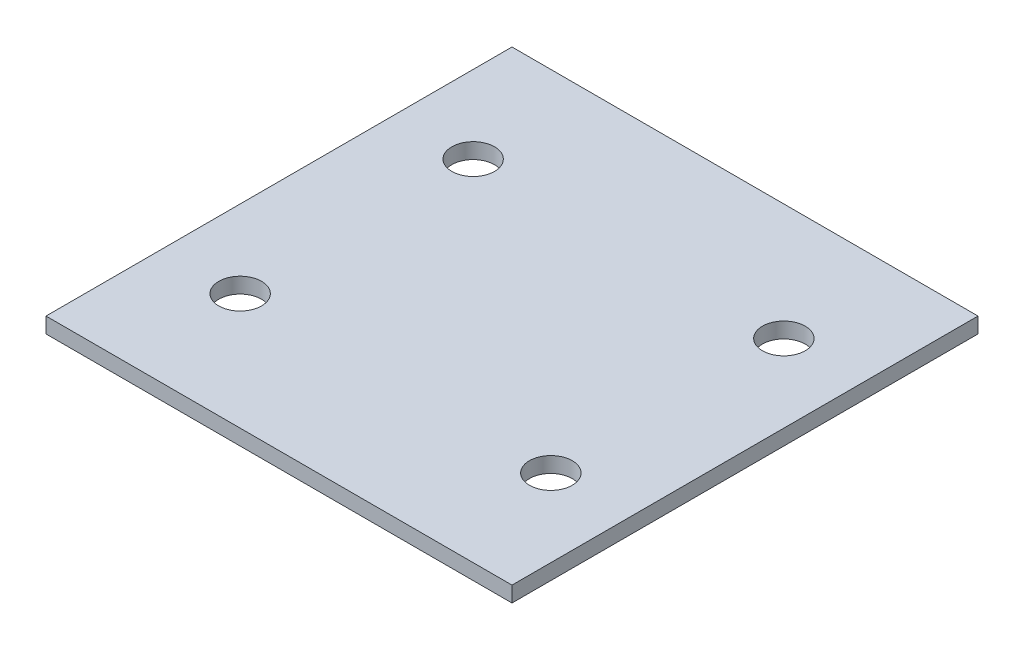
ISO-10303-21;
HEADER;
FILE_DESCRIPTION(('STEP AP214'),'2;1');
FILE_NAME('part.step','',(''),(''),'','','');
FILE_SCHEMA(('AUTOMOTIVE_DESIGN { 1 0 10303 214 1 1 1 1 }'));
ENDSEC;
DATA;
#1=APPLICATION_CONTEXT('core data for automotive mechanical design processes');
#2=APPLICATION_PROTOCOL_DEFINITION('international standard','automotive_design',2000,#1);
#3=PRODUCT_CONTEXT('',#1,'mechanical');
#4=PRODUCT('Part','Part','',(#3));
#5=PRODUCT_RELATED_PRODUCT_CATEGORY('part','',(#4));
#6=PRODUCT_DEFINITION_FORMATION('','',#4);
#7=PRODUCT_DEFINITION_CONTEXT('part definition',#1,'design');
#8=PRODUCT_DEFINITION('design','',#6,#7);
#9=PRODUCT_DEFINITION_SHAPE('','',#8);
#10=(LENGTH_UNIT() NAMED_UNIT(*) SI_UNIT(.MILLI.,.METRE.));
#11=(NAMED_UNIT(*) PLANE_ANGLE_UNIT() SI_UNIT($,.RADIAN.));
#12=(NAMED_UNIT(*) SI_UNIT($,.STERADIAN.) SOLID_ANGLE_UNIT());
#13=UNCERTAINTY_MEASURE_WITH_UNIT(LENGTH_MEASURE(1.E-05),#10,'distance_accuracy_value','');
#14=(GEOMETRIC_REPRESENTATION_CONTEXT(3) GLOBAL_UNCERTAINTY_ASSIGNED_CONTEXT((#13)) GLOBAL_UNIT_ASSIGNED_CONTEXT((#10,
#11,#12)) REPRESENTATION_CONTEXT('',''));
#15=CARTESIAN_POINT('',(0.,0.,0.));
#16=DIRECTION('',(0.,0.,1.));
#17=DIRECTION('',(1.,0.,0.));
#18=AXIS2_PLACEMENT_3D('',#15,#16,#17);
#19=CARTESIAN_POINT('',(0.,4.,0.));
#20=DIRECTION('',(0.,-1.,0.));
#21=DIRECTION('',(0.,0.,-1.));
#22=AXIS2_PLACEMENT_3D('',#19,#20,#21);
#23=PLANE('',#22);
#24=DIRECTION('',(0.,0.,1.));
#25=VECTOR('',#24,1.);
#26=CARTESIAN_POINT('',(-60.,4.,60.));
#27=LINE('',#26,#25);
#28=CARTESIAN_POINT('',(-60.,4.,-60.));
#29=VERTEX_POINT('',#28);
#30=CARTESIAN_POINT('',(-60.,4.,60.));
#31=VERTEX_POINT('',#30);
#32=EDGE_CURVE('E93',#29,#31,#27,.T.);
#33=ORIENTED_EDGE('',*,*,#32,.T.);
#34=DIRECTION('',(1.,0.,0.));
#35=VECTOR('',#34,1.);
#36=CARTESIAN_POINT('',(-60.,4.,60.));
#37=LINE('',#36,#35);
#38=CARTESIAN_POINT('',(60.,4.,60.));
#39=VERTEX_POINT('',#38);
#40=EDGE_CURVE('E88',#31,#39,#37,.T.);
#41=ORIENTED_EDGE('',*,*,#40,.T.);
#42=DIRECTION('',(0.,0.,-1.));
#43=VECTOR('',#42,1.);
#44=CARTESIAN_POINT('',(60.,4.,60.));
#45=LINE('',#44,#43);
#46=CARTESIAN_POINT('',(60.,4.,-60.));
#47=VERTEX_POINT('',#46);
#48=EDGE_CURVE('E90',#39,#47,#45,.T.);
#49=ORIENTED_EDGE('',*,*,#48,.T.);
#50=DIRECTION('',(-1.,0.,0.));
#51=VECTOR('',#50,1.);
#52=CARTESIAN_POINT('',(-60.,4.,-60.));
#53=LINE('',#52,#51);
#54=EDGE_CURVE('E57',#47,#29,#53,.T.);
#55=ORIENTED_EDGE('',*,*,#54,.T.);
#56=EDGE_LOOP('',(#33,#41,#49,#55));
#57=FACE_BOUND('',#56,.T.);
#58=CARTESIAN_POINT('',(-40.,4.,30.));
#59=DIRECTION('',(0.,1.,0.));
#60=DIRECTION('',(0.,0.,1.));
#61=AXIS2_PLACEMENT_3D('',#58,#59,#60);
#62=CIRCLE('',#61,5.5);
#63=CARTESIAN_POINT('',(-40.,4.,35.5));
#64=VERTEX_POINT('',#63);
#65=EDGE_CURVE('E106',#64,#64,#62,.T.);
#66=ORIENTED_EDGE('',*,*,#65,.F.);
#67=EDGE_LOOP('',(#66));
#68=FACE_BOUND('',#67,.T.);
#69=CARTESIAN_POINT('',(-40.,4.,-30.));
#70=DIRECTION('',(0.,1.,0.));
#71=DIRECTION('',(0.,0.,1.));
#72=AXIS2_PLACEMENT_3D('',#69,#70,#71);
#73=CIRCLE('',#72,5.5);
#74=CARTESIAN_POINT('',(-40.,4.,-24.5));
#75=VERTEX_POINT('',#74);
#76=EDGE_CURVE('E123',#75,#75,#73,.T.);
#77=ORIENTED_EDGE('',*,*,#76,.F.);
#78=EDGE_LOOP('',(#77));
#79=FACE_BOUND('',#78,.T.);
#80=CARTESIAN_POINT('',(40.,4.,30.));
#81=DIRECTION('',(0.,1.,0.));
#82=DIRECTION('',(0.,0.,1.));
#83=AXIS2_PLACEMENT_3D('',#80,#81,#82);
#84=CIRCLE('',#83,5.5);
#85=CARTESIAN_POINT('',(40.,4.,35.5));
#86=VERTEX_POINT('',#85);
#87=EDGE_CURVE('E130',#86,#86,#84,.T.);
#88=ORIENTED_EDGE('',*,*,#87,.F.);
#89=EDGE_LOOP('',(#88));
#90=FACE_BOUND('',#89,.T.);
#91=CARTESIAN_POINT('',(40.,4.,-30.));
#92=DIRECTION('',(0.,1.,0.));
#93=DIRECTION('',(0.,0.,1.));
#94=AXIS2_PLACEMENT_3D('',#91,#92,#93);
#95=CIRCLE('',#94,5.5);
#96=CARTESIAN_POINT('',(40.,4.,-24.5));
#97=VERTEX_POINT('',#96);
#98=EDGE_CURVE('E135',#97,#97,#95,.T.);
#99=ORIENTED_EDGE('',*,*,#98,.F.);
#100=EDGE_LOOP('',(#99));
#101=FACE_BOUND('',#100,.T.);
#102=ADVANCED_FACE('F39',(#57,#68,#79,#90,#101),#23,.F.);
#103=CARTESIAN_POINT('',(0.,0.,0.));
#104=DIRECTION('',(0.,-1.,0.));
#105=DIRECTION('',(0.,0.,-1.));
#106=AXIS2_PLACEMENT_3D('',#103,#104,#105);
#107=PLANE('',#106);
#108=CARTESIAN_POINT('',(40.,0.,30.));
#109=DIRECTION('',(0.,1.,0.));
#110=DIRECTION('',(0.,0.,1.));
#111=AXIS2_PLACEMENT_3D('',#108,#109,#110);
#112=CIRCLE('',#111,5.5);
#113=CARTESIAN_POINT('',(40.,0.,35.5));
#114=VERTEX_POINT('',#113);
#115=EDGE_CURVE('E128',#114,#114,#112,.T.);
#116=ORIENTED_EDGE('',*,*,#115,.T.);
#117=EDGE_LOOP('',(#116));
#118=FACE_BOUND('',#117,.T.);
#119=CARTESIAN_POINT('',(-40.,0.,30.));
#120=DIRECTION('',(0.,1.,0.));
#121=DIRECTION('',(0.,0.,1.));
#122=AXIS2_PLACEMENT_3D('',#119,#120,#121);
#123=CIRCLE('',#122,5.5);
#124=CARTESIAN_POINT('',(-40.,0.,35.5));
#125=VERTEX_POINT('',#124);
#126=EDGE_CURVE('E120',#125,#125,#123,.T.);
#127=ORIENTED_EDGE('',*,*,#126,.T.);
#128=EDGE_LOOP('',(#127));
#129=FACE_BOUND('',#128,.T.);
#130=DIRECTION('',(0.,0.,1.));
#131=VECTOR('',#130,1.);
#132=CARTESIAN_POINT('',(-60.,0.,60.));
#133=LINE('',#132,#131);
#134=CARTESIAN_POINT('',(-60.,0.,-60.));
#135=VERTEX_POINT('',#134);
#136=CARTESIAN_POINT('',(-60.,0.,60.));
#137=VERTEX_POINT('',#136);
#138=EDGE_CURVE('E103',#135,#137,#133,.T.);
#139=ORIENTED_EDGE('',*,*,#138,.F.);
#140=DIRECTION('',(-1.,0.,0.));
#141=VECTOR('',#140,1.);
#142=CARTESIAN_POINT('',(-60.,0.,-60.));
#143=LINE('',#142,#141);
#144=CARTESIAN_POINT('',(60.,0.,-60.));
#145=VERTEX_POINT('',#144);
#146=EDGE_CURVE('E76',#145,#135,#143,.T.);
#147=ORIENTED_EDGE('',*,*,#146,.F.);
#148=DIRECTION('',(0.,0.,-1.));
#149=VECTOR('',#148,1.);
#150=CARTESIAN_POINT('',(60.,0.,60.));
#151=LINE('',#150,#149);
#152=CARTESIAN_POINT('',(60.,0.,60.));
#153=VERTEX_POINT('',#152);
#154=EDGE_CURVE('E71',#153,#145,#151,.T.);
#155=ORIENTED_EDGE('',*,*,#154,.F.);
#156=DIRECTION('',(1.,0.,0.));
#157=VECTOR('',#156,1.);
#158=CARTESIAN_POINT('',(-60.,0.,60.));
#159=LINE('',#158,#157);
#160=EDGE_CURVE('E92',#137,#153,#159,.T.);
#161=ORIENTED_EDGE('',*,*,#160,.F.);
#162=EDGE_LOOP('',(#139,#147,#155,#161));
#163=FACE_BOUND('',#162,.T.);
#164=CARTESIAN_POINT('',(-40.,0.,-30.));
#165=DIRECTION('',(0.,1.,0.));
#166=DIRECTION('',(0.,0.,1.));
#167=AXIS2_PLACEMENT_3D('',#164,#165,#166);
#168=CIRCLE('',#167,5.5);
#169=CARTESIAN_POINT('',(-40.,0.,-24.5));
#170=VERTEX_POINT('',#169);
#171=EDGE_CURVE('E122',#170,#170,#168,.T.);
#172=ORIENTED_EDGE('',*,*,#171,.T.);
#173=EDGE_LOOP('',(#172));
#174=FACE_BOUND('',#173,.T.);
#175=CARTESIAN_POINT('',(40.,0.,-30.));
#176=DIRECTION('',(0.,1.,0.));
#177=DIRECTION('',(0.,0.,1.));
#178=AXIS2_PLACEMENT_3D('',#175,#176,#177);
#179=CIRCLE('',#178,5.5);
#180=CARTESIAN_POINT('',(40.,0.,-24.5));
#181=VERTEX_POINT('',#180);
#182=EDGE_CURVE('E138',#181,#181,#179,.T.);
#183=ORIENTED_EDGE('',*,*,#182,.T.);
#184=EDGE_LOOP('',(#183));
#185=FACE_BOUND('',#184,.T.);
#186=ADVANCED_FACE('F111',(#118,#129,#163,#174,#185),#107,.T.);
#187=CARTESIAN_POINT('',(-60.,4.,60.));
#188=DIRECTION('',(1.,0.,0.));
#189=DIRECTION('',(0.,0.,-1.));
#190=AXIS2_PLACEMENT_3D('',#187,#188,#189);
#191=PLANE('',#190);
#192=ORIENTED_EDGE('',*,*,#138,.T.);
#193=DIRECTION('',(0.,-1.,0.));
#194=VECTOR('',#193,1.);
#195=CARTESIAN_POINT('',(-60.,4.,60.));
#196=LINE('',#195,#194);
#197=EDGE_CURVE('E11',#31,#137,#196,.T.);
#198=ORIENTED_EDGE('',*,*,#197,.F.);
#199=ORIENTED_EDGE('',*,*,#32,.F.);
#200=DIRECTION('',(0.,-1.,0.));
#201=VECTOR('',#200,1.);
#202=CARTESIAN_POINT('',(-60.,4.,-60.));
#203=LINE('',#202,#201);
#204=EDGE_CURVE('E97',#29,#135,#203,.T.);
#205=ORIENTED_EDGE('',*,*,#204,.T.);
#206=EDGE_LOOP('',(#192,#198,#199,#205));
#207=FACE_BOUND('',#206,.T.);
#208=ADVANCED_FACE('F41',(#207),#191,.F.);
#209=CARTESIAN_POINT('',(-60.,4.,60.));
#210=DIRECTION('',(0.,0.,-1.));
#211=DIRECTION('',(-1.,0.,0.));
#212=AXIS2_PLACEMENT_3D('',#209,#210,#211);
#213=PLANE('',#212);
#214=ORIENTED_EDGE('',*,*,#160,.T.);
#215=DIRECTION('',(0.,-1.,0.));
#216=VECTOR('',#215,1.);
#217=CARTESIAN_POINT('',(60.,4.,60.));
#218=LINE('',#217,#216);
#219=EDGE_CURVE('E48',#39,#153,#218,.T.);
#220=ORIENTED_EDGE('',*,*,#219,.F.);
#221=ORIENTED_EDGE('',*,*,#40,.F.);
#222=ORIENTED_EDGE('',*,*,#197,.T.);
#223=EDGE_LOOP('',(#214,#220,#221,#222));
#224=FACE_BOUND('',#223,.T.);
#225=ADVANCED_FACE('F94',(#224),#213,.F.);
#226=CARTESIAN_POINT('',(60.,4.,60.));
#227=DIRECTION('',(-1.,0.,0.));
#228=DIRECTION('',(0.,0.,1.));
#229=AXIS2_PLACEMENT_3D('',#226,#227,#228);
#230=PLANE('',#229);
#231=ORIENTED_EDGE('',*,*,#154,.T.);
#232=DIRECTION('',(0.,-1.,0.));
#233=VECTOR('',#232,1.);
#234=CARTESIAN_POINT('',(60.,4.,-60.));
#235=LINE('',#234,#233);
#236=EDGE_CURVE('E96',#47,#145,#235,.T.);
#237=ORIENTED_EDGE('',*,*,#236,.F.);
#238=ORIENTED_EDGE('',*,*,#48,.F.);
#239=ORIENTED_EDGE('',*,*,#219,.T.);
#240=EDGE_LOOP('',(#231,#237,#238,#239));
#241=FACE_BOUND('',#240,.T.);
#242=ADVANCED_FACE('F100',(#241),#230,.F.);
#243=CARTESIAN_POINT('',(-60.,4.,-60.));
#244=DIRECTION('',(0.,0.,1.));
#245=DIRECTION('',(1.,0.,0.));
#246=AXIS2_PLACEMENT_3D('',#243,#244,#245);
#247=PLANE('',#246);
#248=ORIENTED_EDGE('',*,*,#146,.T.);
#249=ORIENTED_EDGE('',*,*,#204,.F.);
#250=ORIENTED_EDGE('',*,*,#54,.F.);
#251=ORIENTED_EDGE('',*,*,#236,.T.);
#252=EDGE_LOOP('',(#248,#249,#250,#251));
#253=FACE_BOUND('',#252,.T.);
#254=ADVANCED_FACE('F112',(#253),#247,.F.);
#255=CARTESIAN_POINT('',(-40.,4.,30.));
#256=DIRECTION('',(0.,-1.,0.));
#257=DIRECTION('',(0.,0.,-1.));
#258=AXIS2_PLACEMENT_3D('',#255,#256,#257);
#259=CYLINDRICAL_SURFACE('',#258,5.5);
#260=ORIENTED_EDGE('',*,*,#65,.T.);
#261=EDGE_LOOP('',(#260));
#262=FACE_BOUND('',#261,.T.);
#263=ORIENTED_EDGE('',*,*,#126,.F.);
#264=EDGE_LOOP('',(#263));
#265=FACE_BOUND('',#264,.T.);
#266=ADVANCED_FACE('F153',(#262,#265),#259,.F.);
#267=CARTESIAN_POINT('',(-40.,4.,-30.));
#268=DIRECTION('',(0.,-1.,0.));
#269=DIRECTION('',(0.,0.,-1.));
#270=AXIS2_PLACEMENT_3D('',#267,#268,#269);
#271=CYLINDRICAL_SURFACE('',#270,5.5);
#272=ORIENTED_EDGE('',*,*,#76,.T.);
#273=EDGE_LOOP('',(#272));
#274=FACE_BOUND('',#273,.T.);
#275=ORIENTED_EDGE('',*,*,#171,.F.);
#276=EDGE_LOOP('',(#275));
#277=FACE_BOUND('',#276,.T.);
#278=ADVANCED_FACE('F196',(#274,#277),#271,.F.);
#279=CARTESIAN_POINT('',(40.,4.,30.));
#280=DIRECTION('',(0.,-1.,0.));
#281=DIRECTION('',(0.,0.,-1.));
#282=AXIS2_PLACEMENT_3D('',#279,#280,#281);
#283=CYLINDRICAL_SURFACE('',#282,5.5);
#284=ORIENTED_EDGE('',*,*,#87,.T.);
#285=EDGE_LOOP('',(#284));
#286=FACE_BOUND('',#285,.T.);
#287=ORIENTED_EDGE('',*,*,#115,.F.);
#288=EDGE_LOOP('',(#287));
#289=FACE_BOUND('',#288,.T.);
#290=ADVANCED_FACE('F206',(#286,#289),#283,.F.);
#291=CARTESIAN_POINT('',(40.,4.,-30.));
#292=DIRECTION('',(0.,-1.,0.));
#293=DIRECTION('',(0.,0.,-1.));
#294=AXIS2_PLACEMENT_3D('',#291,#292,#293);
#295=CYLINDRICAL_SURFACE('',#294,5.5);
#296=ORIENTED_EDGE('',*,*,#98,.T.);
#297=EDGE_LOOP('',(#296));
#298=FACE_BOUND('',#297,.T.);
#299=ORIENTED_EDGE('',*,*,#182,.F.);
#300=EDGE_LOOP('',(#299));
#301=FACE_BOUND('',#300,.T.);
#302=ADVANCED_FACE('F142',(#298,#301),#295,.F.);
#303=CLOSED_SHELL('',(#102,#186,#208,#225,#242,#254,#266,#278,#290,#302));
#304=MANIFOLD_SOLID_BREP('B2',#303);
#305=ADVANCED_BREP_SHAPE_REPRESENTATION('',(#18,#304),#14);
#306=SHAPE_DEFINITION_REPRESENTATION(#9,#305);
ENDSEC;
END-ISO-10303-21;
